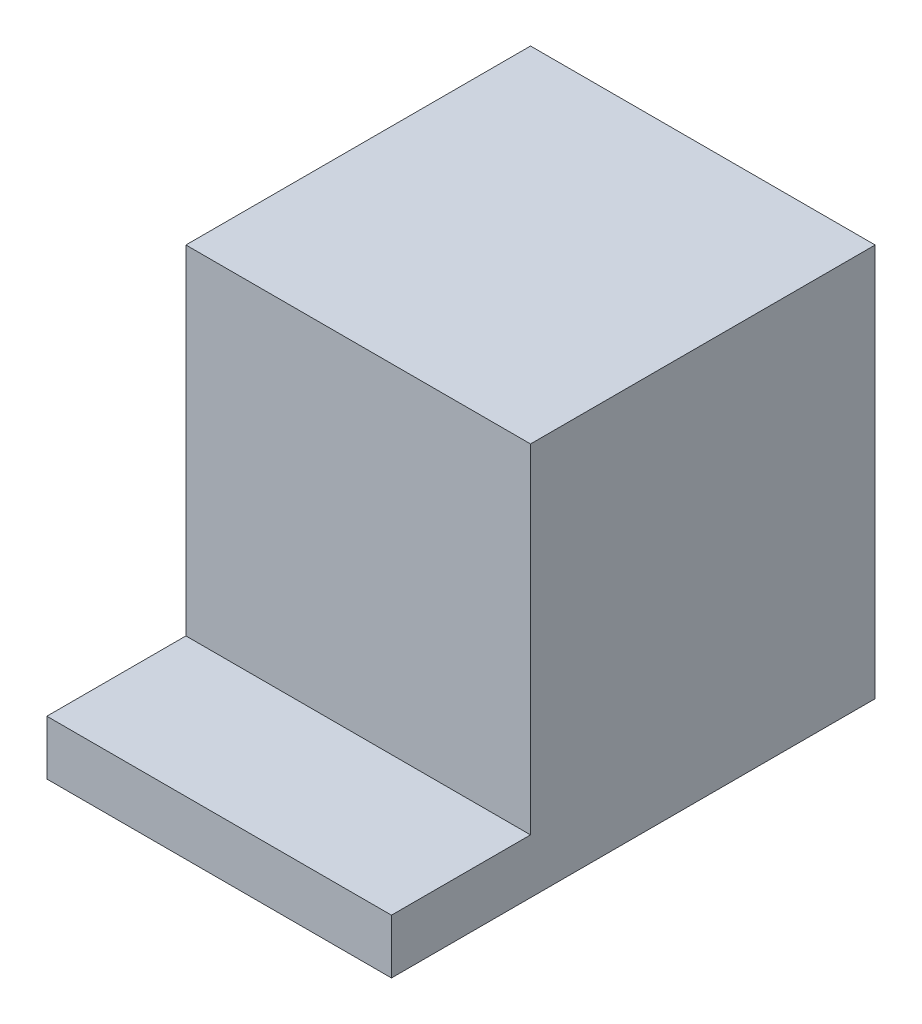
ISO-10303-21;
HEADER;
FILE_DESCRIPTION(('STEP AP214'),'2;1');
FILE_NAME('part.step','',(''),(''),'','','');
FILE_SCHEMA(('AUTOMOTIVE_DESIGN { 1 0 10303 214 1 1 1 1 }'));
ENDSEC;
DATA;
#1=APPLICATION_CONTEXT('core data for automotive mechanical design processes');
#2=APPLICATION_PROTOCOL_DEFINITION('international standard','automotive_design',2000,#1);
#3=PRODUCT_CONTEXT('',#1,'mechanical');
#4=PRODUCT('Part','Part','',(#3));
#5=PRODUCT_RELATED_PRODUCT_CATEGORY('part','',(#4));
#6=PRODUCT_DEFINITION_FORMATION('','',#4);
#7=PRODUCT_DEFINITION_CONTEXT('part definition',#1,'design');
#8=PRODUCT_DEFINITION('design','',#6,#7);
#9=PRODUCT_DEFINITION_SHAPE('','',#8);
#10=(LENGTH_UNIT() NAMED_UNIT(*) SI_UNIT(.MILLI.,.METRE.));
#11=(NAMED_UNIT(*) PLANE_ANGLE_UNIT() SI_UNIT($,.RADIAN.));
#12=(NAMED_UNIT(*) SI_UNIT($,.STERADIAN.) SOLID_ANGLE_UNIT());
#13=UNCERTAINTY_MEASURE_WITH_UNIT(LENGTH_MEASURE(1.E-05),#10,'distance_accuracy_value','');
#14=(GEOMETRIC_REPRESENTATION_CONTEXT(3) GLOBAL_UNCERTAINTY_ASSIGNED_CONTEXT((#13)) GLOBAL_UNIT_ASSIGNED_CONTEXT((#10,
#11,#12)) REPRESENTATION_CONTEXT('',''));
#15=CARTESIAN_POINT('',(0.,0.,0.));
#16=DIRECTION('',(0.,0.,1.));
#17=DIRECTION('',(1.,0.,0.));
#18=AXIS2_PLACEMENT_3D('',#15,#16,#17);
#19=CARTESIAN_POINT('',(0.,9.,0.));
#20=DIRECTION('',(0.,-1.,0.));
#21=DIRECTION('',(0.,0.,-1.));
#22=AXIS2_PLACEMENT_3D('',#19,#20,#21);
#23=PLANE('',#22);
#24=DIRECTION('',(1.,0.,0.));
#25=VECTOR('',#24,1.);
#26=CARTESIAN_POINT('',(0.,9.,-23.));
#27=LINE('',#26,#25);
#28=CARTESIAN_POINT('',(0.,9.,-23.));
#29=VERTEX_POINT('',#28);
#30=CARTESIAN_POINT('',(57.,9.,-23.));
#31=VERTEX_POINT('',#30);
#32=EDGE_CURVE('E55',#29,#31,#27,.T.);
#33=ORIENTED_EDGE('',*,*,#32,.F.);
#34=DIRECTION('',(0.,0.,1.));
#35=VECTOR('',#34,1.);
#36=CARTESIAN_POINT('',(0.,9.,0.));
#37=LINE('',#36,#35);
#38=CARTESIAN_POINT('',(0.,9.,0.));
#39=VERTEX_POINT('',#38);
#40=EDGE_CURVE('E93',#29,#39,#37,.T.);
#41=ORIENTED_EDGE('',*,*,#40,.T.);
#42=DIRECTION('',(1.,0.,0.));
#43=VECTOR('',#42,1.);
#44=CARTESIAN_POINT('',(0.,9.,0.));
#45=LINE('',#44,#43);
#46=CARTESIAN_POINT('',(57.,9.,0.));
#47=VERTEX_POINT('',#46);
#48=EDGE_CURVE('E61',#39,#47,#45,.T.);
#49=ORIENTED_EDGE('',*,*,#48,.T.);
#50=DIRECTION('',(0.,0.,-1.));
#51=VECTOR('',#50,1.);
#52=CARTESIAN_POINT('',(57.,9.,0.));
#53=LINE('',#52,#51);
#54=EDGE_CURVE('E105',#47,#31,#53,.T.);
#55=ORIENTED_EDGE('',*,*,#54,.T.);
#56=EDGE_LOOP('',(#33,#41,#49,#55));
#57=FACE_BOUND('',#56,.T.);
#58=ADVANCED_FACE('F39',(#57),#23,.F.);
#59=CARTESIAN_POINT('',(0.,9.,0.));
#60=DIRECTION('',(1.,0.,0.));
#61=DIRECTION('',(0.,0.,-1.));
#62=AXIS2_PLACEMENT_3D('',#59,#60,#61);
#63=PLANE('',#62);
#64=DIRECTION('',(0.,0.,1.));
#65=VECTOR('',#64,1.);
#66=CARTESIAN_POINT('',(0.,0.,0.));
#67=LINE('',#66,#65);
#68=CARTESIAN_POINT('',(0.,0.,-80.));
#69=VERTEX_POINT('',#68);
#70=CARTESIAN_POINT('',(0.,0.,0.));
#71=VERTEX_POINT('',#70);
#72=EDGE_CURVE('E100',#69,#71,#67,.T.);
#73=ORIENTED_EDGE('',*,*,#72,.T.);
#74=DIRECTION('',(0.,-1.,0.));
#75=VECTOR('',#74,1.);
#76=CARTESIAN_POINT('',(0.,9.,0.));
#77=LINE('',#76,#75);
#78=EDGE_CURVE('E11',#39,#71,#77,.T.);
#79=ORIENTED_EDGE('',*,*,#78,.F.);
#80=ORIENTED_EDGE('',*,*,#40,.F.);
#81=DIRECTION('',(0.,-1.,0.));
#82=VECTOR('',#81,1.);
#83=CARTESIAN_POINT('',(0.,65.,-23.));
#84=LINE('',#83,#82);
#85=CARTESIAN_POINT('',(0.,65.,-23.));
#86=VERTEX_POINT('',#85);
#87=EDGE_CURVE('E110',#86,#29,#84,.T.);
#88=ORIENTED_EDGE('',*,*,#87,.F.);
#89=DIRECTION('',(0.,0.,1.));
#90=VECTOR('',#89,1.);
#91=CARTESIAN_POINT('',(0.,65.,-80.));
#92=LINE('',#91,#90);
#93=CARTESIAN_POINT('',(0.,65.,-80.));
#94=VERTEX_POINT('',#93);
#95=EDGE_CURVE('E103',#94,#86,#92,.T.);
#96=ORIENTED_EDGE('',*,*,#95,.F.);
#97=DIRECTION('',(0.,-1.,0.));
#98=VECTOR('',#97,1.);
#99=CARTESIAN_POINT('',(0.,9.,-80.));
#100=LINE('',#99,#98);
#101=EDGE_CURVE('E85',#94,#69,#100,.T.);
#102=ORIENTED_EDGE('',*,*,#101,.T.);
#103=EDGE_LOOP('',(#73,#79,#80,#88,#96,#102));
#104=FACE_BOUND('',#103,.T.);
#105=ADVANCED_FACE('F41',(#104),#63,.F.);
#106=CARTESIAN_POINT('',(0.,9.,0.));
#107=DIRECTION('',(0.,0.,-1.));
#108=DIRECTION('',(-1.,0.,0.));
#109=AXIS2_PLACEMENT_3D('',#106,#107,#108);
#110=PLANE('',#109);
#111=DIRECTION('',(1.,0.,0.));
#112=VECTOR('',#111,1.);
#113=CARTESIAN_POINT('',(0.,0.,0.));
#114=LINE('',#113,#112);
#115=CARTESIAN_POINT('',(57.,0.,0.));
#116=VERTEX_POINT('',#115);
#117=EDGE_CURVE('E108',#71,#116,#114,.T.);
#118=ORIENTED_EDGE('',*,*,#117,.T.);
#119=DIRECTION('',(0.,-1.,0.));
#120=VECTOR('',#119,1.);
#121=CARTESIAN_POINT('',(57.,9.,0.));
#122=LINE('',#121,#120);
#123=EDGE_CURVE('E48',#47,#116,#122,.T.);
#124=ORIENTED_EDGE('',*,*,#123,.F.);
#125=ORIENTED_EDGE('',*,*,#48,.F.);
#126=ORIENTED_EDGE('',*,*,#78,.T.);
#127=EDGE_LOOP('',(#118,#124,#125,#126));
#128=FACE_BOUND('',#127,.T.);
#129=ADVANCED_FACE('F131',(#128),#110,.F.);
#130=CARTESIAN_POINT('',(57.,9.,0.));
#131=DIRECTION('',(-1.,0.,0.));
#132=DIRECTION('',(0.,0.,1.));
#133=AXIS2_PLACEMENT_3D('',#130,#131,#132);
#134=PLANE('',#133);
#135=DIRECTION('',(0.,0.,-1.));
#136=VECTOR('',#135,1.);
#137=CARTESIAN_POINT('',(57.,0.,0.));
#138=LINE('',#137,#136);
#139=CARTESIAN_POINT('',(57.,0.,-80.));
#140=VERTEX_POINT('',#139);
#141=EDGE_CURVE('E94',#116,#140,#138,.T.);
#142=ORIENTED_EDGE('',*,*,#141,.T.);
#143=DIRECTION('',(0.,-1.,0.));
#144=VECTOR('',#143,1.);
#145=CARTESIAN_POINT('',(57.,9.,-80.));
#146=LINE('',#145,#144);
#147=CARTESIAN_POINT('',(57.,65.,-80.));
#148=VERTEX_POINT('',#147);
#149=EDGE_CURVE('E88',#148,#140,#146,.T.);
#150=ORIENTED_EDGE('',*,*,#149,.F.);
#151=DIRECTION('',(0.,0.,-1.));
#152=VECTOR('',#151,1.);
#153=CARTESIAN_POINT('',(57.,65.,-80.));
#154=LINE('',#153,#152);
#155=CARTESIAN_POINT('',(57.,65.,-23.));
#156=VERTEX_POINT('',#155);
#157=EDGE_CURVE('E148',#156,#148,#154,.T.);
#158=ORIENTED_EDGE('',*,*,#157,.F.);
#159=DIRECTION('',(0.,-1.,0.));
#160=VECTOR('',#159,1.);
#161=CARTESIAN_POINT('',(57.,65.,-23.));
#162=LINE('',#161,#160);
#163=EDGE_CURVE('E116',#156,#31,#162,.T.);
#164=ORIENTED_EDGE('',*,*,#163,.T.);
#165=ORIENTED_EDGE('',*,*,#54,.F.);
#166=ORIENTED_EDGE('',*,*,#123,.T.);
#167=EDGE_LOOP('',(#142,#150,#158,#164,#165,#166));
#168=FACE_BOUND('',#167,.T.);
#169=ADVANCED_FACE('F128',(#168),#134,.F.);
#170=CARTESIAN_POINT('',(0.,9.,-80.));
#171=DIRECTION('',(0.,0.,1.));
#172=DIRECTION('',(1.,0.,0.));
#173=AXIS2_PLACEMENT_3D('',#170,#171,#172);
#174=PLANE('',#173);
#175=DIRECTION('',(-1.,0.,0.));
#176=VECTOR('',#175,1.);
#177=CARTESIAN_POINT('',(0.,0.,-80.));
#178=LINE('',#177,#176);
#179=EDGE_CURVE('E81',#140,#69,#178,.T.);
#180=ORIENTED_EDGE('',*,*,#179,.T.);
#181=ORIENTED_EDGE('',*,*,#101,.F.);
#182=DIRECTION('',(-1.,0.,0.));
#183=VECTOR('',#182,1.);
#184=CARTESIAN_POINT('',(0.,65.,-80.));
#185=LINE('',#184,#183);
#186=EDGE_CURVE('E151',#148,#94,#185,.T.);
#187=ORIENTED_EDGE('',*,*,#186,.F.);
#188=ORIENTED_EDGE('',*,*,#149,.T.);
#189=EDGE_LOOP('',(#180,#181,#187,#188));
#190=FACE_BOUND('',#189,.T.);
#191=ADVANCED_FACE('F83',(#190),#174,.F.);
#192=CARTESIAN_POINT('',(0.,0.,0.));
#193=DIRECTION('',(0.,-1.,0.));
#194=DIRECTION('',(0.,0.,-1.));
#195=AXIS2_PLACEMENT_3D('',#192,#193,#194);
#196=PLANE('',#195);
#197=ORIENTED_EDGE('',*,*,#72,.F.);
#198=ORIENTED_EDGE('',*,*,#179,.F.);
#199=ORIENTED_EDGE('',*,*,#141,.F.);
#200=ORIENTED_EDGE('',*,*,#117,.F.);
#201=EDGE_LOOP('',(#197,#198,#199,#200));
#202=FACE_BOUND('',#201,.T.);
#203=ADVANCED_FACE('F107',(#202),#196,.T.);
#204=CARTESIAN_POINT('',(0.,65.,-23.));
#205=DIRECTION('',(0.,0.,-1.));
#206=DIRECTION('',(-1.,0.,0.));
#207=AXIS2_PLACEMENT_3D('',#204,#205,#206);
#208=PLANE('',#207);
#209=ORIENTED_EDGE('',*,*,#32,.T.);
#210=ORIENTED_EDGE('',*,*,#163,.F.);
#211=DIRECTION('',(1.,0.,0.));
#212=VECTOR('',#211,1.);
#213=CARTESIAN_POINT('',(0.,65.,-23.));
#214=LINE('',#213,#212);
#215=EDGE_CURVE('E141',#86,#156,#214,.T.);
#216=ORIENTED_EDGE('',*,*,#215,.F.);
#217=ORIENTED_EDGE('',*,*,#87,.T.);
#218=EDGE_LOOP('',(#209,#210,#216,#217));
#219=FACE_BOUND('',#218,.T.);
#220=ADVANCED_FACE('F137',(#219),#208,.F.);
#221=CARTESIAN_POINT('',(0.,65.,0.));
#222=DIRECTION('',(0.,1.,0.));
#223=DIRECTION('',(0.,0.,1.));
#224=AXIS2_PLACEMENT_3D('',#221,#222,#223);
#225=PLANE('',#224);
#226=ORIENTED_EDGE('',*,*,#95,.T.);
#227=ORIENTED_EDGE('',*,*,#215,.T.);
#228=ORIENTED_EDGE('',*,*,#157,.T.);
#229=ORIENTED_EDGE('',*,*,#186,.T.);
#230=EDGE_LOOP('',(#226,#227,#228,#229));
#231=FACE_BOUND('',#230,.T.);
#232=ADVANCED_FACE('F150',(#231),#225,.T.);
#233=CLOSED_SHELL('',(#58,#105,#129,#169,#191,#203,#220,#232));
#234=MANIFOLD_SOLID_BREP('B2',#233);
#235=ADVANCED_BREP_SHAPE_REPRESENTATION('',(#18,#234),#14);
#236=SHAPE_DEFINITION_REPRESENTATION(#9,#235);
ENDSEC;
END-ISO-10303-21;
